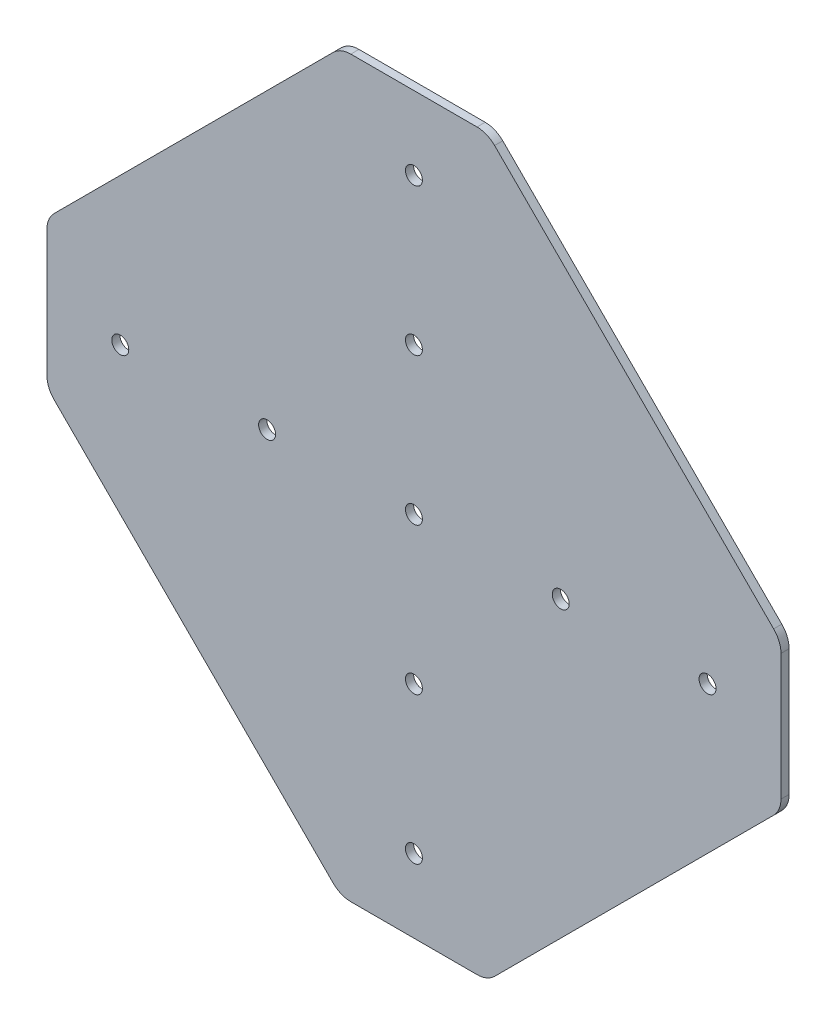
ISO-10303-21;
HEADER;
FILE_DESCRIPTION(('STEP AP214'),'2;1');
FILE_NAME('part.step','',(''),(''),'','','');
FILE_SCHEMA(('AUTOMOTIVE_DESIGN { 1 0 10303 214 1 1 1 1 }'));
ENDSEC;
DATA;
#1=APPLICATION_CONTEXT('core data for automotive mechanical design processes');
#2=APPLICATION_PROTOCOL_DEFINITION('international standard','automotive_design',2000,#1);
#3=PRODUCT_CONTEXT('',#1,'mechanical');
#4=PRODUCT('Part','Part','',(#3));
#5=PRODUCT_RELATED_PRODUCT_CATEGORY('part','',(#4));
#6=PRODUCT_DEFINITION_FORMATION('','',#4);
#7=PRODUCT_DEFINITION_CONTEXT('part definition',#1,'design');
#8=PRODUCT_DEFINITION('design','',#6,#7);
#9=PRODUCT_DEFINITION_SHAPE('','',#8);
#10=(LENGTH_UNIT() NAMED_UNIT(*) SI_UNIT(.MILLI.,.METRE.));
#11=(NAMED_UNIT(*) PLANE_ANGLE_UNIT() SI_UNIT($,.RADIAN.));
#12=(NAMED_UNIT(*) SI_UNIT($,.STERADIAN.) SOLID_ANGLE_UNIT());
#13=UNCERTAINTY_MEASURE_WITH_UNIT(LENGTH_MEASURE(1.E-05),#10,'distance_accuracy_value','');
#14=(GEOMETRIC_REPRESENTATION_CONTEXT(3) GLOBAL_UNCERTAINTY_ASSIGNED_CONTEXT((#13)) GLOBAL_UNIT_ASSIGNED_CONTEXT((#10,
#11,#12)) REPRESENTATION_CONTEXT('',''));
#15=CARTESIAN_POINT('',(0.,0.,0.));
#16=DIRECTION('',(0.,0.,1.));
#17=DIRECTION('',(1.,0.,0.));
#18=AXIS2_PLACEMENT_3D('',#15,#16,#17);
#19=CARTESIAN_POINT('',(-66.595625,-12.281929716,1.5875));
#20=DIRECTION('',(0.,0.,-1.));
#21=DIRECTION('',(0.,1.,0.));
#22=AXIS2_PLACEMENT_3D('',#19,#20,#21);
#23=CYLINDRICAL_SURFACE('',#22,4.841875);
#24=DIRECTION('',(0.,0.,-1.));
#25=VECTOR('',#24,1.);
#26=CARTESIAN_POINT('',(-71.4375,-12.281929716,0.79375));
#27=LINE('',#26,#25);
#28=CARTESIAN_POINT('',(-71.4375,-12.281929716,1.5875));
#29=VERTEX_POINT('',#28);
#30=CARTESIAN_POINT('',(-71.4375,-12.281929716,0.));
#31=VERTEX_POINT('',#30);
#32=EDGE_CURVE('E255',#29,#31,#27,.T.);
#33=ORIENTED_EDGE('',*,*,#32,.T.);
#34=CARTESIAN_POINT('',(-66.595625,-12.281929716,0.));
#35=DIRECTION('',(0.,0.,-1.));
#36=DIRECTION('',(0.,1.,0.));
#37=AXIS2_PLACEMENT_3D('',#34,#35,#36);
#38=CIRCLE('',#37,4.841875);
#39=CARTESIAN_POINT('',(-70.019347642,-15.705652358,0.));
#40=VERTEX_POINT('',#39);
#41=EDGE_CURVE('E144',#40,#31,#38,.T.);
#42=ORIENTED_EDGE('',*,*,#41,.F.);
#43=DIRECTION('',(0.,0.,1.));
#44=VECTOR('',#43,1.);
#45=CARTESIAN_POINT('',(-70.019347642,-15.705652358,0.79375));
#46=LINE('',#45,#44);
#47=CARTESIAN_POINT('',(-70.019347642,-15.705652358,1.5875));
#48=VERTEX_POINT('',#47);
#49=EDGE_CURVE('E140',#40,#48,#46,.T.);
#50=ORIENTED_EDGE('',*,*,#49,.T.);
#51=CARTESIAN_POINT('',(-66.595625,-12.281929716,1.5875));
#52=DIRECTION('',(0.,0.,-1.));
#53=DIRECTION('',(0.,1.,0.));
#54=AXIS2_PLACEMENT_3D('',#51,#52,#53);
#55=CIRCLE('',#54,4.841875);
#56=EDGE_CURVE('E192',#48,#29,#55,.T.);
#57=ORIENTED_EDGE('',*,*,#56,.T.);
#58=EDGE_LOOP('',(#33,#42,#50,#57));
#59=FACE_BOUND('',#58,.T.);
#60=ADVANCED_FACE('F15',(#59),#23,.T.);
#61=CARTESIAN_POINT('',(-71.4375,-12.281929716,1.5875));
#62=DIRECTION('',(1.,0.,0.));
#63=DIRECTION('',(0.,0.,-1.));
#64=AXIS2_PLACEMENT_3D('',#61,#62,#63);
#65=PLANE('',#64);
#66=ORIENTED_EDGE('',*,*,#32,.F.);
#67=DIRECTION('',(0.,1.,0.));
#68=VECTOR('',#67,1.);
#69=CARTESIAN_POINT('',(-71.4375,0.,1.5875));
#70=LINE('',#69,#68);
#71=CARTESIAN_POINT('',(-71.4375,12.281929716,1.5875));
#72=VERTEX_POINT('',#71);
#73=EDGE_CURVE('E195',#29,#72,#70,.T.);
#74=ORIENTED_EDGE('',*,*,#73,.T.);
#75=DIRECTION('',(0.,0.,1.));
#76=VECTOR('',#75,1.);
#77=CARTESIAN_POINT('',(-71.4375,12.281929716,0.79375));
#78=LINE('',#77,#76);
#79=CARTESIAN_POINT('',(-71.4375,12.281929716,0.));
#80=VERTEX_POINT('',#79);
#81=EDGE_CURVE('E258',#72,#80,#78,.F.);
#82=ORIENTED_EDGE('',*,*,#81,.T.);
#83=DIRECTION('',(0.,1.,0.));
#84=VECTOR('',#83,1.);
#85=CARTESIAN_POINT('',(-71.4375,0.,0.));
#86=LINE('',#85,#84);
#87=EDGE_CURVE('E145',#31,#80,#86,.T.);
#88=ORIENTED_EDGE('',*,*,#87,.F.);
#89=EDGE_LOOP('',(#66,#74,#82,#88));
#90=FACE_BOUND('',#89,.T.);
#91=ADVANCED_FACE('F358',(#90),#65,.F.);
#92=CARTESIAN_POINT('',(-66.595625,12.281929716,1.5875));
#93=DIRECTION('',(0.,0.,-1.));
#94=DIRECTION('',(0.,1.,0.));
#95=AXIS2_PLACEMENT_3D('',#92,#93,#94);
#96=CYLINDRICAL_SURFACE('',#95,4.841875);
#97=DIRECTION('',(0.,0.,-1.));
#98=VECTOR('',#97,1.);
#99=CARTESIAN_POINT('',(-70.019347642,15.705652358,0.79375));
#100=LINE('',#99,#98);
#101=CARTESIAN_POINT('',(-70.019347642,15.705652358,1.5875));
#102=VERTEX_POINT('',#101);
#103=CARTESIAN_POINT('',(-70.019347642,15.705652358,0.));
#104=VERTEX_POINT('',#103);
#105=EDGE_CURVE('E261',#102,#104,#100,.T.);
#106=ORIENTED_EDGE('',*,*,#105,.T.);
#107=CARTESIAN_POINT('',(-66.595625,12.281929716,0.));
#108=DIRECTION('',(0.,0.,-1.));
#109=DIRECTION('',(0.,1.,0.));
#110=AXIS2_PLACEMENT_3D('',#107,#108,#109);
#111=CIRCLE('',#110,4.841875);
#112=EDGE_CURVE('E148',#80,#104,#111,.T.);
#113=ORIENTED_EDGE('',*,*,#112,.F.);
#114=ORIENTED_EDGE('',*,*,#81,.F.);
#115=CARTESIAN_POINT('',(-66.595625,12.281929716,1.5875));
#116=DIRECTION('',(0.,0.,-1.));
#117=DIRECTION('',(0.,1.,0.));
#118=AXIS2_PLACEMENT_3D('',#115,#116,#117);
#119=CIRCLE('',#118,4.841875);
#120=EDGE_CURVE('E196',#72,#102,#119,.T.);
#121=ORIENTED_EDGE('',*,*,#120,.T.);
#122=EDGE_LOOP('',(#106,#113,#114,#121));
#123=FACE_BOUND('',#122,.T.);
#124=ADVANCED_FACE('F354',(#123),#96,.T.);
#125=CARTESIAN_POINT('',(-70.019347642,15.705652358,0.));
#126=DIRECTION('',(0.707106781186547,-0.707106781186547,0.));
#127=DIRECTION('',(0.707106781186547,0.707106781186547,0.));
#128=AXIS2_PLACEMENT_3D('',#125,#126,#127);
#129=PLANE('',#128);
#130=DIRECTION('',(0.,0.,1.));
#131=VECTOR('',#130,1.);
#132=CARTESIAN_POINT('',(-15.7056523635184,70.0193476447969,0.79375));
#133=LINE('',#132,#131);
#134=CARTESIAN_POINT('',(-15.7056523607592,70.0193476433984,1.5875));
#135=VERTEX_POINT('',#134);
#136=CARTESIAN_POINT('',(-15.7056523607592,70.0193476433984,0.));
#137=VERTEX_POINT('',#136);
#138=EDGE_CURVE('E264',#135,#137,#133,.F.);
#139=ORIENTED_EDGE('',*,*,#138,.T.);
#140=DIRECTION('',(0.707106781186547,0.707106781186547,0.));
#141=VECTOR('',#140,1.);
#142=CARTESIAN_POINT('',(-70.01934761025,15.70565238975,0.));
#143=LINE('',#142,#141);
#144=EDGE_CURVE('E150',#104,#137,#143,.T.);
#145=ORIENTED_EDGE('',*,*,#144,.F.);
#146=ORIENTED_EDGE('',*,*,#105,.F.);
#147=DIRECTION('',(0.707106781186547,0.707106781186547,0.));
#148=VECTOR('',#147,1.);
#149=CARTESIAN_POINT('',(-70.019347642,15.705652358,1.5875));
#150=LINE('',#149,#148);
#151=EDGE_CURVE('E199',#102,#135,#150,.T.);
#152=ORIENTED_EDGE('',*,*,#151,.T.);
#153=EDGE_LOOP('',(#139,#145,#146,#152));
#154=FACE_BOUND('',#153,.T.);
#155=ADVANCED_FACE('F350',(#154),#129,.F.);
#156=CARTESIAN_POINT('',(-12.281929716,66.595625,1.5875));
#157=DIRECTION('',(0.,0.,-1.));
#158=DIRECTION('',(0.,1.,0.));
#159=AXIS2_PLACEMENT_3D('',#156,#157,#158);
#160=CYLINDRICAL_SURFACE('',#159,4.841875);
#161=DIRECTION('',(0.,0.,-1.));
#162=VECTOR('',#161,1.);
#163=CARTESIAN_POINT('',(-12.281929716,71.4375,0.79375));
#164=LINE('',#163,#162);
#165=CARTESIAN_POINT('',(-12.281929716,71.4375,1.5875));
#166=VERTEX_POINT('',#165);
#167=CARTESIAN_POINT('',(-12.281929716,71.4375,0.));
#168=VERTEX_POINT('',#167);
#169=EDGE_CURVE('E267',#166,#168,#164,.T.);
#170=ORIENTED_EDGE('',*,*,#169,.T.);
#171=CARTESIAN_POINT('',(-12.281929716,66.595625,0.));
#172=DIRECTION('',(0.,0.,-1.));
#173=DIRECTION('',(0.,1.,0.));
#174=AXIS2_PLACEMENT_3D('',#171,#172,#173);
#175=CIRCLE('',#174,4.841875);
#176=EDGE_CURVE('E152',#137,#168,#175,.T.);
#177=ORIENTED_EDGE('',*,*,#176,.F.);
#178=ORIENTED_EDGE('',*,*,#138,.F.);
#179=CARTESIAN_POINT('',(-12.281929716,66.595625,1.5875));
#180=DIRECTION('',(0.,0.,-1.));
#181=DIRECTION('',(0.,1.,0.));
#182=AXIS2_PLACEMENT_3D('',#179,#180,#181);
#183=CIRCLE('',#182,4.841875);
#184=EDGE_CURVE('E202',#135,#166,#183,.T.);
#185=ORIENTED_EDGE('',*,*,#184,.T.);
#186=EDGE_LOOP('',(#170,#177,#178,#185));
#187=FACE_BOUND('',#186,.T.);
#188=ADVANCED_FACE('F346',(#187),#160,.T.);
#189=CARTESIAN_POINT('',(-12.281929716,71.4375,1.5875));
#190=DIRECTION('',(0.,-1.,0.));
#191=DIRECTION('',(0.,0.,-1.));
#192=AXIS2_PLACEMENT_3D('',#189,#190,#191);
#193=PLANE('',#192);
#194=DIRECTION('',(0.,0.,1.));
#195=VECTOR('',#194,1.);
#196=CARTESIAN_POINT('',(12.2819297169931,71.4375,0.79375));
#197=LINE('',#196,#195);
#198=CARTESIAN_POINT('',(12.2819297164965,71.4375,1.5875));
#199=VERTEX_POINT('',#198);
#200=CARTESIAN_POINT('',(12.2819297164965,71.4375,0.));
#201=VERTEX_POINT('',#200);
#202=EDGE_CURVE('E270',#199,#201,#197,.F.);
#203=ORIENTED_EDGE('',*,*,#202,.T.);
#204=DIRECTION('',(1.,0.,0.));
#205=VECTOR('',#204,1.);
#206=CARTESIAN_POINT('',(0.,71.4375,0.));
#207=LINE('',#206,#205);
#208=EDGE_CURVE('E154',#168,#201,#207,.T.);
#209=ORIENTED_EDGE('',*,*,#208,.F.);
#210=ORIENTED_EDGE('',*,*,#169,.F.);
#211=DIRECTION('',(1.,0.,0.));
#212=VECTOR('',#211,1.);
#213=CARTESIAN_POINT('',(0.,71.4375,1.5875));
#214=LINE('',#213,#212);
#215=EDGE_CURVE('E205',#166,#199,#214,.T.);
#216=ORIENTED_EDGE('',*,*,#215,.T.);
#217=EDGE_LOOP('',(#203,#209,#210,#216));
#218=FACE_BOUND('',#217,.T.);
#219=ADVANCED_FACE('F342',(#218),#193,.F.);
#220=CARTESIAN_POINT('',(12.281929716,66.595625,1.5875));
#221=DIRECTION('',(0.,0.,-1.));
#222=DIRECTION('',(0.,1.,0.));
#223=AXIS2_PLACEMENT_3D('',#220,#221,#222);
#224=CYLINDRICAL_SURFACE('',#223,4.841875);
#225=DIRECTION('',(0.,0.,-1.));
#226=VECTOR('',#225,1.);
#227=CARTESIAN_POINT('',(15.705652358,70.019347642,0.79375));
#228=LINE('',#227,#226);
#229=CARTESIAN_POINT('',(15.705652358,70.019347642,1.5875));
#230=VERTEX_POINT('',#229);
#231=CARTESIAN_POINT('',(15.705652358,70.019347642,0.));
#232=VERTEX_POINT('',#231);
#233=EDGE_CURVE('E273',#230,#232,#228,.T.);
#234=ORIENTED_EDGE('',*,*,#233,.T.);
#235=CARTESIAN_POINT('',(12.281929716,66.595625,0.));
#236=DIRECTION('',(0.,0.,-1.));
#237=DIRECTION('',(0.,1.,0.));
#238=AXIS2_PLACEMENT_3D('',#235,#236,#237);
#239=CIRCLE('',#238,4.841875);
#240=EDGE_CURVE('E155',#201,#232,#239,.T.);
#241=ORIENTED_EDGE('',*,*,#240,.F.);
#242=ORIENTED_EDGE('',*,*,#202,.F.);
#243=CARTESIAN_POINT('',(12.281929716,66.595625,1.5875));
#244=DIRECTION('',(0.,0.,-1.));
#245=DIRECTION('',(0.,1.,0.));
#246=AXIS2_PLACEMENT_3D('',#243,#244,#245);
#247=CIRCLE('',#246,4.841875);
#248=EDGE_CURVE('E206',#199,#230,#247,.T.);
#249=ORIENTED_EDGE('',*,*,#248,.T.);
#250=EDGE_LOOP('',(#234,#241,#242,#249));
#251=FACE_BOUND('',#250,.T.);
#252=ADVANCED_FACE('F338',(#251),#224,.T.);
#253=CARTESIAN_POINT('',(15.705652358,70.019347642,0.));
#254=DIRECTION('',(-0.707106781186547,-0.707106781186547,0.));
#255=DIRECTION('',(0.707106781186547,-0.707106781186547,0.));
#256=AXIS2_PLACEMENT_3D('',#253,#254,#255);
#257=PLANE('',#256);
#258=DIRECTION('',(0.,0.,1.));
#259=VECTOR('',#258,1.);
#260=CARTESIAN_POINT('',(70.0193476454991,15.7056523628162,0.79375));
#261=LINE('',#260,#259);
#262=CARTESIAN_POINT('',(70.0193476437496,15.7056523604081,1.5875));
#263=VERTEX_POINT('',#262);
#264=CARTESIAN_POINT('',(70.0193476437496,15.7056523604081,0.));
#265=VERTEX_POINT('',#264);
#266=EDGE_CURVE('E276',#263,#265,#261,.F.);
#267=ORIENTED_EDGE('',*,*,#266,.T.);
#268=DIRECTION('',(0.707106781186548,-0.707106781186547,0.));
#269=VECTOR('',#268,1.);
#270=CARTESIAN_POINT('',(15.70565238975,70.01934761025,0.));
#271=LINE('',#270,#269);
#272=EDGE_CURVE('E157',#232,#265,#271,.T.);
#273=ORIENTED_EDGE('',*,*,#272,.F.);
#274=ORIENTED_EDGE('',*,*,#233,.F.);
#275=DIRECTION('',(0.707106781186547,-0.707106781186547,0.));
#276=VECTOR('',#275,1.);
#277=CARTESIAN_POINT('',(15.705652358,70.019347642,1.5875));
#278=LINE('',#277,#276);
#279=EDGE_CURVE('E209',#230,#263,#278,.T.);
#280=ORIENTED_EDGE('',*,*,#279,.T.);
#281=EDGE_LOOP('',(#267,#273,#274,#280));
#282=FACE_BOUND('',#281,.T.);
#283=ADVANCED_FACE('F334',(#282),#257,.F.);
#284=CARTESIAN_POINT('',(66.595625,12.281929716,1.5875));
#285=DIRECTION('',(0.,0.,-1.));
#286=DIRECTION('',(0.,1.,0.));
#287=AXIS2_PLACEMENT_3D('',#284,#285,#286);
#288=CYLINDRICAL_SURFACE('',#287,4.84187500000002);
#289=DIRECTION('',(0.,0.,-1.));
#290=VECTOR('',#289,1.);
#291=CARTESIAN_POINT('',(71.4375,12.281929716,0.79375));
#292=LINE('',#291,#290);
#293=CARTESIAN_POINT('',(71.4375,12.281929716,1.5875));
#294=VERTEX_POINT('',#293);
#295=CARTESIAN_POINT('',(71.4375,12.281929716,0.));
#296=VERTEX_POINT('',#295);
#297=EDGE_CURVE('E279',#294,#296,#292,.T.);
#298=ORIENTED_EDGE('',*,*,#297,.T.);
#299=CARTESIAN_POINT('',(66.595625,12.281929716,0.));
#300=DIRECTION('',(0.,0.,-1.));
#301=DIRECTION('',(0.,1.,0.));
#302=AXIS2_PLACEMENT_3D('',#299,#300,#301);
#303=CIRCLE('',#302,4.84187500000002);
#304=EDGE_CURVE('E159',#265,#296,#303,.T.);
#305=ORIENTED_EDGE('',*,*,#304,.F.);
#306=ORIENTED_EDGE('',*,*,#266,.F.);
#307=CARTESIAN_POINT('',(66.595625,12.281929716,1.5875));
#308=DIRECTION('',(0.,0.,-1.));
#309=DIRECTION('',(0.,1.,0.));
#310=AXIS2_PLACEMENT_3D('',#307,#308,#309);
#311=CIRCLE('',#310,4.84187500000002);
#312=EDGE_CURVE('E212',#263,#294,#311,.T.);
#313=ORIENTED_EDGE('',*,*,#312,.T.);
#314=EDGE_LOOP('',(#298,#305,#306,#313));
#315=FACE_BOUND('',#314,.T.);
#316=ADVANCED_FACE('F330',(#315),#288,.T.);
#317=CARTESIAN_POINT('',(71.4375,-12.281929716,0.));
#318=DIRECTION('',(-1.,0.,0.));
#319=DIRECTION('',(0.,0.,1.));
#320=AXIS2_PLACEMENT_3D('',#317,#318,#319);
#321=PLANE('',#320);
#322=DIRECTION('',(0.,0.,1.));
#323=VECTOR('',#322,1.);
#324=CARTESIAN_POINT('',(71.4375,-12.2819297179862,0.79375));
#325=LINE('',#324,#323);
#326=CARTESIAN_POINT('',(71.4375,-12.2819297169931,1.5875));
#327=VERTEX_POINT('',#326);
#328=CARTESIAN_POINT('',(71.4375,-12.2819297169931,0.));
#329=VERTEX_POINT('',#328);
#330=EDGE_CURVE('E282',#327,#329,#325,.F.);
#331=ORIENTED_EDGE('',*,*,#330,.T.);
#332=DIRECTION('',(0.,-1.,0.));
#333=VECTOR('',#332,1.);
#334=CARTESIAN_POINT('',(71.4375,0.,0.));
#335=LINE('',#334,#333);
#336=EDGE_CURVE('E161',#296,#329,#335,.T.);
#337=ORIENTED_EDGE('',*,*,#336,.F.);
#338=ORIENTED_EDGE('',*,*,#297,.F.);
#339=DIRECTION('',(0.,-1.,0.));
#340=VECTOR('',#339,1.);
#341=CARTESIAN_POINT('',(71.4375,0.,1.5875));
#342=LINE('',#341,#340);
#343=EDGE_CURVE('E215',#294,#327,#342,.T.);
#344=ORIENTED_EDGE('',*,*,#343,.T.);
#345=EDGE_LOOP('',(#331,#337,#338,#344));
#346=FACE_BOUND('',#345,.T.);
#347=ADVANCED_FACE('F326',(#346),#321,.F.);
#348=CARTESIAN_POINT('',(66.595625,-12.281929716,1.5875));
#349=DIRECTION('',(0.,0.,-1.));
#350=DIRECTION('',(0.,1.,0.));
#351=AXIS2_PLACEMENT_3D('',#348,#349,#350);
#352=CYLINDRICAL_SURFACE('',#351,4.84187500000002);
#353=DIRECTION('',(0.,0.,-1.));
#354=VECTOR('',#353,1.);
#355=CARTESIAN_POINT('',(70.019347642,-15.705652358,0.79375));
#356=LINE('',#355,#354);
#357=CARTESIAN_POINT('',(70.019347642,-15.705652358,1.5875));
#358=VERTEX_POINT('',#357);
#359=CARTESIAN_POINT('',(70.019347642,-15.705652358,0.));
#360=VERTEX_POINT('',#359);
#361=EDGE_CURVE('E285',#358,#360,#356,.T.);
#362=ORIENTED_EDGE('',*,*,#361,.T.);
#363=CARTESIAN_POINT('',(66.595625,-12.281929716,0.));
#364=DIRECTION('',(0.,0.,-1.));
#365=DIRECTION('',(0.,1.,0.));
#366=AXIS2_PLACEMENT_3D('',#363,#364,#365);
#367=CIRCLE('',#366,4.84187500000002);
#368=EDGE_CURVE('E162',#329,#360,#367,.T.);
#369=ORIENTED_EDGE('',*,*,#368,.F.);
#370=ORIENTED_EDGE('',*,*,#330,.F.);
#371=CARTESIAN_POINT('',(66.595625,-12.281929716,1.5875));
#372=DIRECTION('',(0.,0.,-1.));
#373=DIRECTION('',(0.,1.,0.));
#374=AXIS2_PLACEMENT_3D('',#371,#372,#373);
#375=CIRCLE('',#374,4.84187500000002);
#376=EDGE_CURVE('E216',#327,#358,#375,.T.);
#377=ORIENTED_EDGE('',*,*,#376,.T.);
#378=EDGE_LOOP('',(#362,#369,#370,#377));
#379=FACE_BOUND('',#378,.T.);
#380=ADVANCED_FACE('F322',(#379),#352,.T.);
#381=CARTESIAN_POINT('',(70.019347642,-15.705652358,0.));
#382=DIRECTION('',(-0.707106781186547,0.707106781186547,0.));
#383=DIRECTION('',(-0.707106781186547,-0.707106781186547,0.));
#384=AXIS2_PLACEMENT_3D('',#381,#382,#383);
#385=PLANE('',#384);
#386=DIRECTION('',(0.,0.,1.));
#387=VECTOR('',#386,1.);
#388=CARTESIAN_POINT('',(15.7056523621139,-70.0193476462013,0.79375));
#389=LINE('',#388,#387);
#390=CARTESIAN_POINT('',(15.705652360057,-70.0193476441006,1.5875));
#391=VERTEX_POINT('',#390);
#392=CARTESIAN_POINT('',(15.705652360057,-70.0193476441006,0.));
#393=VERTEX_POINT('',#392);
#394=EDGE_CURVE('E288',#391,#393,#389,.F.);
#395=ORIENTED_EDGE('',*,*,#394,.T.);
#396=DIRECTION('',(-0.707106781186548,-0.707106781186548,0.));
#397=VECTOR('',#396,1.);
#398=CARTESIAN_POINT('',(70.01934761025,-15.70565238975,0.));
#399=LINE('',#398,#397);
#400=EDGE_CURVE('E164',#360,#393,#399,.T.);
#401=ORIENTED_EDGE('',*,*,#400,.F.);
#402=ORIENTED_EDGE('',*,*,#361,.F.);
#403=DIRECTION('',(-0.707106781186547,-0.707106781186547,0.));
#404=VECTOR('',#403,1.);
#405=CARTESIAN_POINT('',(70.019347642,-15.705652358,1.5875));
#406=LINE('',#405,#404);
#407=EDGE_CURVE('E219',#358,#391,#406,.T.);
#408=ORIENTED_EDGE('',*,*,#407,.T.);
#409=EDGE_LOOP('',(#395,#401,#402,#408));
#410=FACE_BOUND('',#409,.T.);
#411=ADVANCED_FACE('F318',(#410),#385,.F.);
#412=CARTESIAN_POINT('',(12.281929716,-66.595625,1.5875));
#413=DIRECTION('',(0.,0.,-1.));
#414=DIRECTION('',(0.,1.,0.));
#415=AXIS2_PLACEMENT_3D('',#412,#413,#414);
#416=CYLINDRICAL_SURFACE('',#415,4.841875);
#417=DIRECTION('',(0.,0.,-1.));
#418=VECTOR('',#417,1.);
#419=CARTESIAN_POINT('',(12.281929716,-71.4375,0.79375));
#420=LINE('',#419,#418);
#421=CARTESIAN_POINT('',(12.281929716,-71.4375,1.5875));
#422=VERTEX_POINT('',#421);
#423=CARTESIAN_POINT('',(12.281929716,-71.4375,0.));
#424=VERTEX_POINT('',#423);
#425=EDGE_CURVE('E291',#422,#424,#420,.T.);
#426=ORIENTED_EDGE('',*,*,#425,.T.);
#427=CARTESIAN_POINT('',(12.281929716,-66.595625,0.));
#428=DIRECTION('',(0.,0.,-1.));
#429=DIRECTION('',(0.,1.,0.));
#430=AXIS2_PLACEMENT_3D('',#427,#428,#429);
#431=CIRCLE('',#430,4.841875);
#432=EDGE_CURVE('E166',#393,#424,#431,.T.);
#433=ORIENTED_EDGE('',*,*,#432,.F.);
#434=ORIENTED_EDGE('',*,*,#394,.F.);
#435=CARTESIAN_POINT('',(12.281929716,-66.595625,1.5875));
#436=DIRECTION('',(0.,0.,-1.));
#437=DIRECTION('',(0.,1.,0.));
#438=AXIS2_PLACEMENT_3D('',#435,#436,#437);
#439=CIRCLE('',#438,4.841875);
#440=EDGE_CURVE('E222',#391,#422,#439,.T.);
#441=ORIENTED_EDGE('',*,*,#440,.T.);
#442=EDGE_LOOP('',(#426,#433,#434,#441));
#443=FACE_BOUND('',#442,.T.);
#444=ADVANCED_FACE('F314',(#443),#416,.T.);
#445=CARTESIAN_POINT('',(-12.281929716,-71.4375,0.));
#446=DIRECTION('',(0.,1.,0.));
#447=DIRECTION('',(0.,0.,1.));
#448=AXIS2_PLACEMENT_3D('',#445,#446,#447);
#449=PLANE('',#448);
#450=DIRECTION('',(0.,0.,1.));
#451=VECTOR('',#450,1.);
#452=CARTESIAN_POINT('',(-12.2819297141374,-71.4375,0.79375));
#453=LINE('',#452,#451);
#454=CARTESIAN_POINT('',(-12.2819297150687,-71.4375,1.5875));
#455=VERTEX_POINT('',#454);
#456=CARTESIAN_POINT('',(-12.2819297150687,-71.4375,0.));
#457=VERTEX_POINT('',#456);
#458=EDGE_CURVE('E293',#455,#457,#453,.F.);
#459=ORIENTED_EDGE('',*,*,#458,.T.);
#460=DIRECTION('',(-1.,0.,0.));
#461=VECTOR('',#460,1.);
#462=CARTESIAN_POINT('',(0.,-71.4375,0.));
#463=LINE('',#462,#461);
#464=EDGE_CURVE('E128',#424,#457,#463,.T.);
#465=ORIENTED_EDGE('',*,*,#464,.F.);
#466=ORIENTED_EDGE('',*,*,#425,.F.);
#467=DIRECTION('',(-1.,0.,0.));
#468=VECTOR('',#467,1.);
#469=CARTESIAN_POINT('',(0.,-71.4375,1.5875));
#470=LINE('',#469,#468);
#471=EDGE_CURVE('E225',#422,#455,#470,.T.);
#472=ORIENTED_EDGE('',*,*,#471,.T.);
#473=EDGE_LOOP('',(#459,#465,#466,#472));
#474=FACE_BOUND('',#473,.T.);
#475=ADVANCED_FACE('F309',(#474),#449,.F.);
#476=CARTESIAN_POINT('',(-12.281929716,-66.595625,1.5875));
#477=DIRECTION('',(0.,0.,-1.));
#478=DIRECTION('',(0.,1.,0.));
#479=AXIS2_PLACEMENT_3D('',#476,#477,#478);
#480=CYLINDRICAL_SURFACE('',#479,4.841875);
#481=DIRECTION('',(0.,0.,-1.));
#482=VECTOR('',#481,1.);
#483=CARTESIAN_POINT('',(-15.705652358,-70.019347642,0.79375));
#484=LINE('',#483,#482);
#485=CARTESIAN_POINT('',(-15.705652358,-70.019347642,1.5875));
#486=VERTEX_POINT('',#485);
#487=CARTESIAN_POINT('',(-15.705652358,-70.019347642,0.));
#488=VERTEX_POINT('',#487);
#489=EDGE_CURVE('E34',#486,#488,#484,.T.);
#490=ORIENTED_EDGE('',*,*,#489,.T.);
#491=CARTESIAN_POINT('',(-12.281929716,-66.595625,0.));
#492=DIRECTION('',(0.,0.,-1.));
#493=DIRECTION('',(0.,1.,0.));
#494=AXIS2_PLACEMENT_3D('',#491,#492,#493);
#495=CIRCLE('',#494,4.841875);
#496=EDGE_CURVE('E19',#457,#488,#495,.T.);
#497=ORIENTED_EDGE('',*,*,#496,.F.);
#498=ORIENTED_EDGE('',*,*,#458,.F.);
#499=CARTESIAN_POINT('',(-12.281929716,-66.595625,1.5875));
#500=DIRECTION('',(0.,0.,-1.));
#501=DIRECTION('',(0.,1.,0.));
#502=AXIS2_PLACEMENT_3D('',#499,#500,#501);
#503=CIRCLE('',#502,4.841875);
#504=EDGE_CURVE('E139',#455,#486,#503,.T.);
#505=ORIENTED_EDGE('',*,*,#504,.T.);
#506=EDGE_LOOP('',(#490,#497,#498,#505));
#507=FACE_BOUND('',#506,.T.);
#508=ADVANCED_FACE('F137',(#507),#480,.T.);
#509=CARTESIAN_POINT('',(-15.705652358,-70.019347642,0.));
#510=DIRECTION('',(0.707106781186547,0.707106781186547,0.));
#511=DIRECTION('',(-0.707106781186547,0.707106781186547,0.));
#512=AXIS2_PLACEMENT_3D('',#509,#510,#511);
#513=PLANE('',#512);
#514=ORIENTED_EDGE('',*,*,#489,.F.);
#515=DIRECTION('',(-0.707106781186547,0.707106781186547,0.));
#516=VECTOR('',#515,1.);
#517=CARTESIAN_POINT('',(-15.705652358,-70.019347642,1.5875));
#518=LINE('',#517,#516);
#519=EDGE_CURVE('E227',#486,#48,#518,.T.);
#520=ORIENTED_EDGE('',*,*,#519,.T.);
#521=ORIENTED_EDGE('',*,*,#49,.F.);
#522=DIRECTION('',(-0.707106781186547,0.707106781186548,0.));
#523=VECTOR('',#522,1.);
#524=CARTESIAN_POINT('',(-15.70565238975,-70.01934761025,0.));
#525=LINE('',#524,#523);
#526=EDGE_CURVE('E133',#488,#40,#525,.T.);
#527=ORIENTED_EDGE('',*,*,#526,.F.);
#528=EDGE_LOOP('',(#514,#520,#521,#527));
#529=FACE_BOUND('',#528,.T.);
#530=ADVANCED_FACE('F142',(#529),#513,.F.);
#531=CARTESIAN_POINT('',(-57.15,0.,0.));
#532=DIRECTION('',(0.,0.,1.));
#533=DIRECTION('',(1.,0.,0.));
#534=AXIS2_PLACEMENT_3D('',#531,#532,#533);
#535=CYLINDRICAL_SURFACE('',#534,1.651);
#536=CARTESIAN_POINT('',(-57.15,0.,0.));
#537=DIRECTION('',(0.,0.,1.));
#538=DIRECTION('',(1.,0.,0.));
#539=AXIS2_PLACEMENT_3D('',#536,#537,#538);
#540=CIRCLE('',#539,1.651);
#541=CARTESIAN_POINT('',(-55.499,0.,0.));
#542=VERTEX_POINT('',#541);
#543=EDGE_CURVE('E168',#542,#542,#540,.T.);
#544=ORIENTED_EDGE('',*,*,#543,.F.);
#545=EDGE_LOOP('',(#544));
#546=FACE_BOUND('',#545,.T.);
#547=CARTESIAN_POINT('',(-57.15,0.,1.5875));
#548=DIRECTION('',(0.,0.,1.));
#549=DIRECTION('',(1.,0.,0.));
#550=AXIS2_PLACEMENT_3D('',#547,#548,#549);
#551=CIRCLE('',#550,1.651);
#552=CARTESIAN_POINT('',(-55.499,0.,1.5875));
#553=VERTEX_POINT('',#552);
#554=EDGE_CURVE('E229',#553,#553,#551,.T.);
#555=ORIENTED_EDGE('',*,*,#554,.T.);
#556=EDGE_LOOP('',(#555));
#557=FACE_BOUND('',#556,.T.);
#558=ADVANCED_FACE('F405',(#546,#557),#535,.F.);
#559=CARTESIAN_POINT('',(57.15,0.,0.));
#560=DIRECTION('',(0.,0.,1.));
#561=DIRECTION('',(1.,0.,0.));
#562=AXIS2_PLACEMENT_3D('',#559,#560,#561);
#563=CYLINDRICAL_SURFACE('',#562,1.65099999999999);
#564=CARTESIAN_POINT('',(57.15,0.,0.));
#565=DIRECTION('',(0.,0.,1.));
#566=DIRECTION('',(1.,0.,0.));
#567=AXIS2_PLACEMENT_3D('',#564,#565,#566);
#568=CIRCLE('',#567,1.65099999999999);
#569=CARTESIAN_POINT('',(58.801,0.,0.));
#570=VERTEX_POINT('',#569);
#571=EDGE_CURVE('E171',#570,#570,#568,.T.);
#572=ORIENTED_EDGE('',*,*,#571,.F.);
#573=EDGE_LOOP('',(#572));
#574=FACE_BOUND('',#573,.T.);
#575=CARTESIAN_POINT('',(57.15,0.,1.5875));
#576=DIRECTION('',(0.,0.,1.));
#577=DIRECTION('',(1.,0.,0.));
#578=AXIS2_PLACEMENT_3D('',#575,#576,#577);
#579=CIRCLE('',#578,1.65099999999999);
#580=CARTESIAN_POINT('',(58.801,0.,1.5875));
#581=VERTEX_POINT('',#580);
#582=EDGE_CURVE('E232',#581,#581,#579,.T.);
#583=ORIENTED_EDGE('',*,*,#582,.T.);
#584=EDGE_LOOP('',(#583));
#585=FACE_BOUND('',#584,.T.);
#586=ADVANCED_FACE('F401',(#574,#585),#563,.F.);
#587=CARTESIAN_POINT('',(0.,-28.575,0.));
#588=DIRECTION('',(0.,0.,1.));
#589=DIRECTION('',(1.,0.,0.));
#590=AXIS2_PLACEMENT_3D('',#587,#588,#589);
#591=CYLINDRICAL_SURFACE('',#590,1.651);
#592=CARTESIAN_POINT('',(0.,-28.575,0.));
#593=DIRECTION('',(0.,0.,1.));
#594=DIRECTION('',(1.,0.,0.));
#595=AXIS2_PLACEMENT_3D('',#592,#593,#594);
#596=CIRCLE('',#595,1.651);
#597=CARTESIAN_POINT('',(1.651,-28.575,0.));
#598=VERTEX_POINT('',#597);
#599=EDGE_CURVE('E177',#598,#598,#596,.T.);
#600=ORIENTED_EDGE('',*,*,#599,.F.);
#601=EDGE_LOOP('',(#600));
#602=FACE_BOUND('',#601,.T.);
#603=CARTESIAN_POINT('',(0.,-28.575,1.5875));
#604=DIRECTION('',(0.,0.,1.));
#605=DIRECTION('',(1.,0.,0.));
#606=AXIS2_PLACEMENT_3D('',#603,#604,#605);
#607=CIRCLE('',#606,1.651);
#608=CARTESIAN_POINT('',(1.651,-28.575,1.5875));
#609=VERTEX_POINT('',#608);
#610=EDGE_CURVE('E235',#609,#609,#607,.T.);
#611=ORIENTED_EDGE('',*,*,#610,.T.);
#612=EDGE_LOOP('',(#611));
#613=FACE_BOUND('',#612,.T.);
#614=ADVANCED_FACE('F397',(#602,#613),#591,.F.);
#615=CARTESIAN_POINT('',(28.575,0.,0.));
#616=DIRECTION('',(0.,0.,1.));
#617=DIRECTION('',(1.,0.,0.));
#618=AXIS2_PLACEMENT_3D('',#615,#616,#617);
#619=CYLINDRICAL_SURFACE('',#618,1.651);
#620=CARTESIAN_POINT('',(28.575,0.,0.));
#621=DIRECTION('',(0.,0.,1.));
#622=DIRECTION('',(1.,0.,0.));
#623=AXIS2_PLACEMENT_3D('',#620,#621,#622);
#624=CIRCLE('',#623,1.651);
#625=CARTESIAN_POINT('',(30.226,0.,0.));
#626=VERTEX_POINT('',#625);
#627=EDGE_CURVE('E186',#626,#626,#624,.T.);
#628=ORIENTED_EDGE('',*,*,#627,.F.);
#629=EDGE_LOOP('',(#628));
#630=FACE_BOUND('',#629,.T.);
#631=CARTESIAN_POINT('',(28.575,0.,1.5875));
#632=DIRECTION('',(0.,0.,1.));
#633=DIRECTION('',(1.,0.,0.));
#634=AXIS2_PLACEMENT_3D('',#631,#632,#633);
#635=CIRCLE('',#634,1.651);
#636=CARTESIAN_POINT('',(30.226,0.,1.5875));
#637=VERTEX_POINT('',#636);
#638=EDGE_CURVE('E238',#637,#637,#635,.T.);
#639=ORIENTED_EDGE('',*,*,#638,.T.);
#640=EDGE_LOOP('',(#639));
#641=FACE_BOUND('',#640,.T.);
#642=ADVANCED_FACE('F393',(#630,#641),#619,.F.);
#643=CARTESIAN_POINT('',(-28.575,0.,0.));
#644=DIRECTION('',(0.,0.,1.));
#645=DIRECTION('',(1.,0.,0.));
#646=AXIS2_PLACEMENT_3D('',#643,#644,#645);
#647=CYLINDRICAL_SURFACE('',#646,1.651);
#648=CARTESIAN_POINT('',(-28.575,0.,0.));
#649=DIRECTION('',(0.,0.,1.));
#650=DIRECTION('',(1.,0.,0.));
#651=AXIS2_PLACEMENT_3D('',#648,#649,#650);
#652=CIRCLE('',#651,1.651);
#653=CARTESIAN_POINT('',(-26.924,0.,0.));
#654=VERTEX_POINT('',#653);
#655=EDGE_CURVE('E183',#654,#654,#652,.T.);
#656=ORIENTED_EDGE('',*,*,#655,.F.);
#657=EDGE_LOOP('',(#656));
#658=FACE_BOUND('',#657,.T.);
#659=CARTESIAN_POINT('',(-28.575,0.,1.5875));
#660=DIRECTION('',(0.,0.,1.));
#661=DIRECTION('',(1.,0.,0.));
#662=AXIS2_PLACEMENT_3D('',#659,#660,#661);
#663=CIRCLE('',#662,1.651);
#664=CARTESIAN_POINT('',(-26.924,0.,1.5875));
#665=VERTEX_POINT('',#664);
#666=EDGE_CURVE('E241',#665,#665,#663,.T.);
#667=ORIENTED_EDGE('',*,*,#666,.T.);
#668=EDGE_LOOP('',(#667));
#669=FACE_BOUND('',#668,.T.);
#670=ADVANCED_FACE('F389',(#658,#669),#647,.F.);
#671=CARTESIAN_POINT('',(0.,57.15,0.));
#672=DIRECTION('',(0.,0.,1.));
#673=DIRECTION('',(1.,0.,0.));
#674=AXIS2_PLACEMENT_3D('',#671,#672,#673);
#675=CYLINDRICAL_SURFACE('',#674,1.651);
#676=CARTESIAN_POINT('',(0.,57.15,0.));
#677=DIRECTION('',(0.,0.,1.));
#678=DIRECTION('',(1.,0.,0.));
#679=AXIS2_PLACEMENT_3D('',#676,#677,#678);
#680=CIRCLE('',#679,1.651);
#681=CARTESIAN_POINT('',(1.651,57.15,0.));
#682=VERTEX_POINT('',#681);
#683=EDGE_CURVE('E180',#682,#682,#680,.T.);
#684=ORIENTED_EDGE('',*,*,#683,.F.);
#685=EDGE_LOOP('',(#684));
#686=FACE_BOUND('',#685,.T.);
#687=CARTESIAN_POINT('',(0.,57.15,1.5875));
#688=DIRECTION('',(0.,0.,1.));
#689=DIRECTION('',(1.,0.,0.));
#690=AXIS2_PLACEMENT_3D('',#687,#688,#689);
#691=CIRCLE('',#690,1.651);
#692=CARTESIAN_POINT('',(1.651,57.15,1.5875));
#693=VERTEX_POINT('',#692);
#694=EDGE_CURVE('E244',#693,#693,#691,.T.);
#695=ORIENTED_EDGE('',*,*,#694,.T.);
#696=EDGE_LOOP('',(#695));
#697=FACE_BOUND('',#696,.T.);
#698=ADVANCED_FACE('F385',(#686,#697),#675,.F.);
#699=CARTESIAN_POINT('',(0.,-57.15,0.));
#700=DIRECTION('',(0.,0.,1.));
#701=DIRECTION('',(1.,0.,0.));
#702=AXIS2_PLACEMENT_3D('',#699,#700,#701);
#703=CYLINDRICAL_SURFACE('',#702,1.651);
#704=CARTESIAN_POINT('',(0.,-57.15,0.));
#705=DIRECTION('',(0.,0.,1.));
#706=DIRECTION('',(1.,0.,0.));
#707=AXIS2_PLACEMENT_3D('',#704,#705,#706);
#708=CIRCLE('',#707,1.651);
#709=CARTESIAN_POINT('',(1.651,-57.15,0.));
#710=VERTEX_POINT('',#709);
#711=EDGE_CURVE('E174',#710,#710,#708,.T.);
#712=ORIENTED_EDGE('',*,*,#711,.F.);
#713=EDGE_LOOP('',(#712));
#714=FACE_BOUND('',#713,.T.);
#715=CARTESIAN_POINT('',(0.,-57.15,1.5875));
#716=DIRECTION('',(0.,0.,1.));
#717=DIRECTION('',(1.,0.,0.));
#718=AXIS2_PLACEMENT_3D('',#715,#716,#717);
#719=CIRCLE('',#718,1.651);
#720=CARTESIAN_POINT('',(1.651,-57.15,1.5875));
#721=VERTEX_POINT('',#720);
#722=EDGE_CURVE('E247',#721,#721,#719,.T.);
#723=ORIENTED_EDGE('',*,*,#722,.T.);
#724=EDGE_LOOP('',(#723));
#725=FACE_BOUND('',#724,.T.);
#726=ADVANCED_FACE('F381',(#714,#725),#703,.F.);
#727=CARTESIAN_POINT('',(0.,0.,0.));
#728=DIRECTION('',(0.,0.,1.));
#729=DIRECTION('',(1.,0.,0.));
#730=AXIS2_PLACEMENT_3D('',#727,#728,#729);
#731=CYLINDRICAL_SURFACE('',#730,1.651);
#732=CARTESIAN_POINT('',(0.,0.,0.));
#733=DIRECTION('',(0.,0.,1.));
#734=DIRECTION('',(1.,0.,0.));
#735=AXIS2_PLACEMENT_3D('',#732,#733,#734);
#736=CIRCLE('',#735,1.651);
#737=CARTESIAN_POINT('',(1.651,0.,0.));
#738=VERTEX_POINT('',#737);
#739=EDGE_CURVE('E189',#738,#738,#736,.T.);
#740=ORIENTED_EDGE('',*,*,#739,.F.);
#741=EDGE_LOOP('',(#740));
#742=FACE_BOUND('',#741,.T.);
#743=CARTESIAN_POINT('',(0.,0.,1.5875));
#744=DIRECTION('',(0.,0.,1.));
#745=DIRECTION('',(1.,0.,0.));
#746=AXIS2_PLACEMENT_3D('',#743,#744,#745);
#747=CIRCLE('',#746,1.651);
#748=CARTESIAN_POINT('',(1.651,0.,1.5875));
#749=VERTEX_POINT('',#748);
#750=EDGE_CURVE('E250',#749,#749,#747,.T.);
#751=ORIENTED_EDGE('',*,*,#750,.T.);
#752=EDGE_LOOP('',(#751));
#753=FACE_BOUND('',#752,.T.);
#754=ADVANCED_FACE('F378',(#742,#753),#731,.F.);
#755=CARTESIAN_POINT('',(71.4375,-71.4375,0.));
#756=DIRECTION('',(0.,0.,-1.));
#757=DIRECTION('',(-1.,0.,0.));
#758=AXIS2_PLACEMENT_3D('',#755,#756,#757);
#759=PLANE('',#758);
#760=CARTESIAN_POINT('',(0.,28.575,0.));
#761=DIRECTION('',(0.,0.,1.));
#762=DIRECTION('',(1.,0.,0.));
#763=AXIS2_PLACEMENT_3D('',#760,#761,#762);
#764=CIRCLE('',#763,1.651);
#765=CARTESIAN_POINT('',(1.651,28.575,0.));
#766=VERTEX_POINT('',#765);
#767=EDGE_CURVE('E25',#766,#766,#764,.F.);
#768=ORIENTED_EDGE('',*,*,#767,.F.);
#769=EDGE_LOOP('',(#768));
#770=FACE_BOUND('',#769,.T.);
#771=ORIENTED_EDGE('',*,*,#739,.T.);
#772=EDGE_LOOP('',(#771));
#773=FACE_BOUND('',#772,.T.);
#774=ORIENTED_EDGE('',*,*,#627,.T.);
#775=EDGE_LOOP('',(#774));
#776=FACE_BOUND('',#775,.T.);
#777=ORIENTED_EDGE('',*,*,#655,.T.);
#778=EDGE_LOOP('',(#777));
#779=FACE_BOUND('',#778,.T.);
#780=ORIENTED_EDGE('',*,*,#683,.T.);
#781=EDGE_LOOP('',(#780));
#782=FACE_BOUND('',#781,.T.);
#783=ORIENTED_EDGE('',*,*,#599,.T.);
#784=EDGE_LOOP('',(#783));
#785=FACE_BOUND('',#784,.T.);
#786=ORIENTED_EDGE('',*,*,#711,.T.);
#787=EDGE_LOOP('',(#786));
#788=FACE_BOUND('',#787,.T.);
#789=ORIENTED_EDGE('',*,*,#571,.T.);
#790=EDGE_LOOP('',(#789));
#791=FACE_BOUND('',#790,.T.);
#792=ORIENTED_EDGE('',*,*,#543,.T.);
#793=EDGE_LOOP('',(#792));
#794=FACE_BOUND('',#793,.T.);
#795=ORIENTED_EDGE('',*,*,#400,.T.);
#796=ORIENTED_EDGE('',*,*,#432,.T.);
#797=ORIENTED_EDGE('',*,*,#464,.T.);
#798=ORIENTED_EDGE('',*,*,#496,.T.);
#799=ORIENTED_EDGE('',*,*,#526,.T.);
#800=ORIENTED_EDGE('',*,*,#41,.T.);
#801=ORIENTED_EDGE('',*,*,#87,.T.);
#802=ORIENTED_EDGE('',*,*,#112,.T.);
#803=ORIENTED_EDGE('',*,*,#144,.T.);
#804=ORIENTED_EDGE('',*,*,#176,.T.);
#805=ORIENTED_EDGE('',*,*,#208,.T.);
#806=ORIENTED_EDGE('',*,*,#240,.T.);
#807=ORIENTED_EDGE('',*,*,#272,.T.);
#808=ORIENTED_EDGE('',*,*,#304,.T.);
#809=ORIENTED_EDGE('',*,*,#336,.T.);
#810=ORIENTED_EDGE('',*,*,#368,.T.);
#811=EDGE_LOOP('',(#795,#796,#797,#798,#799,#800,#801,#802,#803,#804,#805,#806,#807,#808,#809,#810));
#812=FACE_BOUND('',#811,.T.);
#813=ADVANCED_FACE('F132',(#770,#773,#776,#779,#782,#785,#788,#791,#794,#812),#759,.T.);
#814=CARTESIAN_POINT('',(71.4375,-71.4375,1.5875));
#815=DIRECTION('',(0.,0.,-1.));
#816=DIRECTION('',(-1.,0.,0.));
#817=AXIS2_PLACEMENT_3D('',#814,#815,#816);
#818=PLANE('',#817);
#819=CARTESIAN_POINT('',(0.,28.575,1.5875));
#820=DIRECTION('',(0.,0.,1.));
#821=DIRECTION('',(1.,0.,0.));
#822=AXIS2_PLACEMENT_3D('',#819,#820,#821);
#823=CIRCLE('',#822,1.651);
#824=CARTESIAN_POINT('',(1.651,28.575,1.5875));
#825=VERTEX_POINT('',#824);
#826=EDGE_CURVE('E9',#825,#825,#823,.T.);
#827=ORIENTED_EDGE('',*,*,#826,.F.);
#828=EDGE_LOOP('',(#827));
#829=FACE_BOUND('',#828,.T.);
#830=ORIENTED_EDGE('',*,*,#750,.F.);
#831=EDGE_LOOP('',(#830));
#832=FACE_BOUND('',#831,.T.);
#833=ORIENTED_EDGE('',*,*,#722,.F.);
#834=EDGE_LOOP('',(#833));
#835=FACE_BOUND('',#834,.T.);
#836=ORIENTED_EDGE('',*,*,#694,.F.);
#837=EDGE_LOOP('',(#836));
#838=FACE_BOUND('',#837,.T.);
#839=ORIENTED_EDGE('',*,*,#666,.F.);
#840=EDGE_LOOP('',(#839));
#841=FACE_BOUND('',#840,.T.);
#842=ORIENTED_EDGE('',*,*,#638,.F.);
#843=EDGE_LOOP('',(#842));
#844=FACE_BOUND('',#843,.T.);
#845=ORIENTED_EDGE('',*,*,#610,.F.);
#846=EDGE_LOOP('',(#845));
#847=FACE_BOUND('',#846,.T.);
#848=ORIENTED_EDGE('',*,*,#582,.F.);
#849=EDGE_LOOP('',(#848));
#850=FACE_BOUND('',#849,.T.);
#851=ORIENTED_EDGE('',*,*,#554,.F.);
#852=EDGE_LOOP('',(#851));
#853=FACE_BOUND('',#852,.T.);
#854=ORIENTED_EDGE('',*,*,#504,.F.);
#855=ORIENTED_EDGE('',*,*,#471,.F.);
#856=ORIENTED_EDGE('',*,*,#440,.F.);
#857=ORIENTED_EDGE('',*,*,#407,.F.);
#858=ORIENTED_EDGE('',*,*,#376,.F.);
#859=ORIENTED_EDGE('',*,*,#343,.F.);
#860=ORIENTED_EDGE('',*,*,#312,.F.);
#861=ORIENTED_EDGE('',*,*,#279,.F.);
#862=ORIENTED_EDGE('',*,*,#248,.F.);
#863=ORIENTED_EDGE('',*,*,#215,.F.);
#864=ORIENTED_EDGE('',*,*,#184,.F.);
#865=ORIENTED_EDGE('',*,*,#151,.F.);
#866=ORIENTED_EDGE('',*,*,#120,.F.);
#867=ORIENTED_EDGE('',*,*,#73,.F.);
#868=ORIENTED_EDGE('',*,*,#56,.F.);
#869=ORIENTED_EDGE('',*,*,#519,.F.);
#870=EDGE_LOOP('',(#854,#855,#856,#857,#858,#859,#860,#861,#862,#863,#864,#865,#866,#867,#868,#869));
#871=FACE_BOUND('',#870,.T.);
#872=ADVANCED_FACE('F17',(#829,#832,#835,#838,#841,#844,#847,#850,#853,#871),#818,.F.);
#873=CARTESIAN_POINT('',(0.,28.575,0.));
#874=DIRECTION('',(0.,0.,1.));
#875=DIRECTION('',(1.,0.,0.));
#876=AXIS2_PLACEMENT_3D('',#873,#874,#875);
#877=CYLINDRICAL_SURFACE('',#876,1.651);
#878=ORIENTED_EDGE('',*,*,#767,.T.);
#879=EDGE_LOOP('',(#878));
#880=FACE_BOUND('',#879,.T.);
#881=ORIENTED_EDGE('',*,*,#826,.T.);
#882=EDGE_LOOP('',(#881));
#883=FACE_BOUND('',#882,.T.);
#884=ADVANCED_FACE('F368',(#880,#883),#877,.F.);
#885=CLOSED_SHELL('',(#60,#91,#124,#155,#188,#219,#252,#283,#316,#347,#380,#411,#444,#475,#508,
#530,#558,#586,#614,#642,#670,#698,#726,#754,#813,#872,#884));
#886=MANIFOLD_SOLID_BREP('B1',#885);
#887=ADVANCED_BREP_SHAPE_REPRESENTATION('',(#18,#886),#14);
#888=SHAPE_DEFINITION_REPRESENTATION(#9,#887);
ENDSEC;
END-ISO-10303-21;
